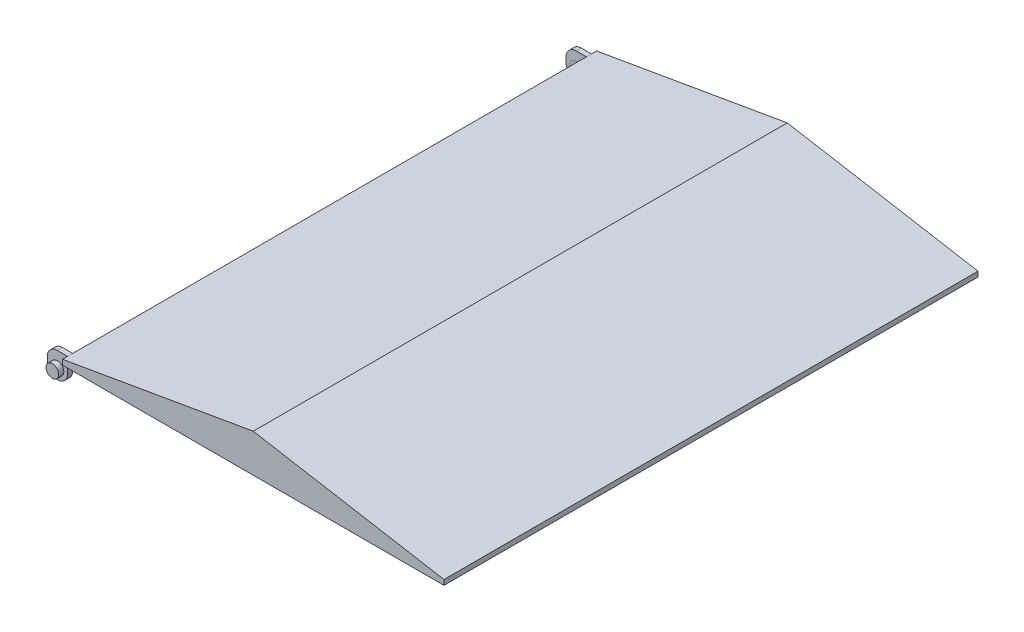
ISO-10303-21;
HEADER;
FILE_DESCRIPTION(('STEP AP214'),'2;1');
FILE_NAME('part.step','',(''),(''),'','','');
FILE_SCHEMA(('AUTOMOTIVE_DESIGN { 1 0 10303 214 1 1 1 1 }'));
ENDSEC;
DATA;
#1=APPLICATION_CONTEXT('core data for automotive mechanical design processes');
#2=APPLICATION_PROTOCOL_DEFINITION('international standard','automotive_design',2000,#1);
#3=PRODUCT_CONTEXT('',#1,'mechanical');
#4=PRODUCT('Part','Part','',(#3));
#5=PRODUCT_RELATED_PRODUCT_CATEGORY('part','',(#4));
#6=PRODUCT_DEFINITION_FORMATION('','',#4);
#7=PRODUCT_DEFINITION_CONTEXT('part definition',#1,'design');
#8=PRODUCT_DEFINITION('design','',#6,#7);
#9=PRODUCT_DEFINITION_SHAPE('','',#8);
#10=(LENGTH_UNIT() NAMED_UNIT(*) SI_UNIT(.MILLI.,.METRE.));
#11=(NAMED_UNIT(*) PLANE_ANGLE_UNIT() SI_UNIT($,.RADIAN.));
#12=(NAMED_UNIT(*) SI_UNIT($,.STERADIAN.) SOLID_ANGLE_UNIT());
#13=UNCERTAINTY_MEASURE_WITH_UNIT(LENGTH_MEASURE(1.E-05),#10,'distance_accuracy_value','');
#14=(GEOMETRIC_REPRESENTATION_CONTEXT(3) GLOBAL_UNCERTAINTY_ASSIGNED_CONTEXT((#13)) GLOBAL_UNIT_ASSIGNED_CONTEXT((#10,
#11,#12)) REPRESENTATION_CONTEXT('',''));
#15=CARTESIAN_POINT('',(0.,0.,0.));
#16=DIRECTION('',(0.,0.,1.));
#17=DIRECTION('',(1.,0.,0.));
#18=AXIS2_PLACEMENT_3D('',#15,#16,#17);
#19=CARTESIAN_POINT('',(-790.,-40.0000000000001,2100.));
#20=DIRECTION('',(0.,0.,-1.));
#21=DIRECTION('',(-1.,0.,0.));
#22=AXIS2_PLACEMENT_3D('',#19,#20,#21);
#23=CYLINDRICAL_SURFACE('',#22,25.);
#24=CARTESIAN_POINT('',(-790.,-40.0000000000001,2100.));
#25=DIRECTION('',(0.,0.,1.));
#26=DIRECTION('',(1.,0.,0.));
#27=AXIS2_PLACEMENT_3D('',#24,#25,#26);
#28=CIRCLE('',#27,25.);
#29=CARTESIAN_POINT('',(-765.,-40.0000000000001,2100.));
#30=VERTEX_POINT('',#29);
#31=EDGE_CURVE('E11',#30,#30,#28,.T.);
#32=ORIENTED_EDGE('',*,*,#31,.F.);
#33=EDGE_LOOP('',(#32));
#34=FACE_BOUND('',#33,.T.);
#35=CARTESIAN_POINT('',(-790.,-40.0000000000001,2060.));
#36=DIRECTION('',(0.,0.,1.));
#37=DIRECTION('',(1.,0.,0.));
#38=AXIS2_PLACEMENT_3D('',#35,#36,#37);
#39=CIRCLE('',#38,25.);
#40=CARTESIAN_POINT('',(-765.,-40.0000000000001,2060.));
#41=VERTEX_POINT('',#40);
#42=EDGE_CURVE('E53',#41,#41,#39,.T.);
#43=ORIENTED_EDGE('',*,*,#42,.T.);
#44=EDGE_LOOP('',(#43));
#45=FACE_BOUND('',#44,.T.);
#46=ADVANCED_FACE('F50',(#34,#45),#23,.T.);
#47=CARTESIAN_POINT('',(0.,0.,2100.));
#48=DIRECTION('',(0.,0.,1.));
#49=DIRECTION('',(1.,0.,0.));
#50=AXIS2_PLACEMENT_3D('',#47,#48,#49);
#51=PLANE('',#50);
#52=ORIENTED_EDGE('',*,*,#31,.T.);
#53=EDGE_LOOP('',(#52));
#54=FACE_BOUND('',#53,.T.);
#55=ADVANCED_FACE('F65',(#54),#51,.T.);
#56=CARTESIAN_POINT('',(0.,0.,2060.));
#57=DIRECTION('',(0.,0.,1.));
#58=DIRECTION('',(1.,0.,0.));
#59=AXIS2_PLACEMENT_3D('',#56,#57,#58);
#60=PLANE('',#59);
#61=ORIENTED_EDGE('',*,*,#42,.F.);
#62=EDGE_LOOP('',(#61));
#63=FACE_BOUND('',#62,.T.);
#64=ADVANCED_FACE('F63',(#63),#60,.F.);
#65=CLOSED_SHELL('',(#46,#55,#64));
#66=MANIFOLD_SOLID_BREP('B2',#65);
#67=CARTESIAN_POINT('',(-790.,-40.0000000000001,40.));
#68=DIRECTION('',(0.,0.,-1.));
#69=DIRECTION('',(-1.,0.,0.));
#70=AXIS2_PLACEMENT_3D('',#67,#68,#69);
#71=CYLINDRICAL_SURFACE('',#70,25.);
#72=CARTESIAN_POINT('',(-790.,-40.0000000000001,40.));
#73=DIRECTION('',(0.,0.,1.));
#74=DIRECTION('',(1.,0.,0.));
#75=AXIS2_PLACEMENT_3D('',#72,#73,#74);
#76=CIRCLE('',#75,25.);
#77=CARTESIAN_POINT('',(-765.,-40.0000000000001,40.));
#78=VERTEX_POINT('',#77);
#79=EDGE_CURVE('E49',#78,#78,#76,.T.);
#80=ORIENTED_EDGE('',*,*,#79,.F.);
#81=EDGE_LOOP('',(#80));
#82=FACE_BOUND('',#81,.T.);
#83=CARTESIAN_POINT('',(-790.,-40.0000000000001,0.));
#84=DIRECTION('',(0.,0.,1.));
#85=DIRECTION('',(1.,0.,0.));
#86=AXIS2_PLACEMENT_3D('',#83,#84,#85);
#87=CIRCLE('',#86,25.);
#88=CARTESIAN_POINT('',(-765.,-40.0000000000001,0.));
#89=VERTEX_POINT('',#88);
#90=EDGE_CURVE('E109',#89,#89,#87,.T.);
#91=ORIENTED_EDGE('',*,*,#90,.T.);
#92=EDGE_LOOP('',(#91));
#93=FACE_BOUND('',#92,.T.);
#94=ADVANCED_FACE('F106',(#82,#93),#71,.T.);
#95=CARTESIAN_POINT('',(0.,0.,40.));
#96=DIRECTION('',(0.,0.,1.));
#97=DIRECTION('',(1.,0.,0.));
#98=AXIS2_PLACEMENT_3D('',#95,#96,#97);
#99=PLANE('',#98);
#100=ORIENTED_EDGE('',*,*,#79,.T.);
#101=EDGE_LOOP('',(#100));
#102=FACE_BOUND('',#101,.T.);
#103=ADVANCED_FACE('F121',(#102),#99,.T.);
#104=CARTESIAN_POINT('',(0.,0.,0.));
#105=DIRECTION('',(0.,0.,1.));
#106=DIRECTION('',(1.,0.,0.));
#107=AXIS2_PLACEMENT_3D('',#104,#105,#106);
#108=PLANE('',#107);
#109=ORIENTED_EDGE('',*,*,#90,.F.);
#110=EDGE_LOOP('',(#109));
#111=FACE_BOUND('',#110,.T.);
#112=ADVANCED_FACE('F119',(#111),#108,.F.);
#113=CLOSED_SHELL('',(#94,#103,#112));
#114=MANIFOLD_SOLID_BREP('B6',#113);
#115=CARTESIAN_POINT('',(-750.,0.,2100.));
#116=DIRECTION('',(1.,0.,0.));
#117=DIRECTION('',(0.,0.,-1.));
#118=AXIS2_PLACEMENT_3D('',#115,#116,#117);
#119=PLANE('',#118);
#120=DIRECTION('',(0.,-1.,0.));
#121=VECTOR('',#120,1.);
#122=CARTESIAN_POINT('',(-750.,0.,2060.));
#123=LINE('',#122,#121);
#124=CARTESIAN_POINT('',(-750.,19.9999999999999,2060.));
#125=VERTEX_POINT('',#124);
#126=CARTESIAN_POINT('',(-750.,0.,2060.));
#127=VERTEX_POINT('',#126);
#128=EDGE_CURVE('E453',#125,#127,#123,.T.);
#129=ORIENTED_EDGE('',*,*,#128,.F.);
#130=DIRECTION('',(0.,0.,-1.));
#131=VECTOR('',#130,1.);
#132=CARTESIAN_POINT('',(-750.,19.9999999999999,2100.));
#133=LINE('',#132,#131);
#134=CARTESIAN_POINT('',(-750.,19.9999999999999,40.));
#135=VERTEX_POINT('',#134);
#136=EDGE_CURVE('E346',#125,#135,#133,.T.);
#137=ORIENTED_EDGE('',*,*,#136,.T.);
#138=DIRECTION('',(0.,-1.,0.));
#139=VECTOR('',#138,1.);
#140=CARTESIAN_POINT('',(-750.,0.,40.));
#141=LINE('',#140,#139);
#142=CARTESIAN_POINT('',(-750.,0.,40.));
#143=VERTEX_POINT('',#142);
#144=EDGE_CURVE('E462',#135,#143,#141,.T.);
#145=ORIENTED_EDGE('',*,*,#144,.T.);
#146=DIRECTION('',(0.,0.,-1.));
#147=VECTOR('',#146,1.);
#148=CARTESIAN_POINT('',(-750.,0.,2100.));
#149=LINE('',#148,#147);
#150=EDGE_CURVE('E367',#127,#143,#149,.T.);
#151=ORIENTED_EDGE('',*,*,#150,.F.);
#152=EDGE_LOOP('',(#129,#137,#145,#151));
#153=FACE_BOUND('',#152,.T.);
#154=ADVANCED_FACE('F154',(#153),#119,.F.);
#155=DIRECTION('',(0.,-1.,0.));
#156=VECTOR('',#155,1.);
#157=CARTESIAN_POINT('',(-750.,0.,20.));
#158=LINE('',#157,#156);
#159=CARTESIAN_POINT('',(-750.,19.9999999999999,20.));
#160=VERTEX_POINT('',#159);
#161=CARTESIAN_POINT('',(-750.,0.,20.));
#162=VERTEX_POINT('',#161);
#163=EDGE_CURVE('E474',#160,#162,#158,.T.);
#164=ORIENTED_EDGE('',*,*,#163,.F.);
#165=CARTESIAN_POINT('',(-750.,19.9999999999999,0.));
#166=VERTEX_POINT('',#165);
#167=EDGE_CURVE('E354',#160,#166,#133,.T.);
#168=ORIENTED_EDGE('',*,*,#167,.T.);
#169=DIRECTION('',(0.,-1.,0.));
#170=VECTOR('',#169,1.);
#171=CARTESIAN_POINT('',(-750.,0.,0.));
#172=LINE('',#171,#170);
#173=CARTESIAN_POINT('',(-750.,0.,0.));
#174=VERTEX_POINT('',#173);
#175=EDGE_CURVE('E525',#166,#174,#172,.T.);
#176=ORIENTED_EDGE('',*,*,#175,.T.);
#177=EDGE_CURVE('E372',#162,#174,#149,.T.);
#178=ORIENTED_EDGE('',*,*,#177,.F.);
#179=EDGE_LOOP('',(#164,#168,#176,#178));
#180=FACE_BOUND('',#179,.T.);
#181=ADVANCED_FACE('F542',(#180),#119,.F.);
#182=CARTESIAN_POINT('',(-25.2416292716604,145.624784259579,2100.));
#183=DIRECTION('',(-0.170786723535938,0.985308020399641,0.));
#184=DIRECTION('',(-0.985308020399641,-0.170786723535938,0.));
#185=AXIS2_PLACEMENT_3D('',#182,#183,#184);
#186=PLANE('',#185);
#187=DIRECTION('',(0.985308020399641,0.170786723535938,0.));
#188=VECTOR('',#187,1.);
#189=CARTESIAN_POINT('',(-25.2416292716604,145.624784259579,0.));
#190=LINE('',#189,#188);
#191=CARTESIAN_POINT('',(0.,150.,0.));
#192=VERTEX_POINT('',#191);
#193=EDGE_CURVE('E514',#166,#192,#190,.T.);
#194=ORIENTED_EDGE('',*,*,#193,.F.);
#195=ORIENTED_EDGE('',*,*,#167,.F.);
#196=DIRECTION('',(0.,0.,-1.));
#197=VECTOR('',#196,1.);
#198=CARTESIAN_POINT('',(-750.,19.9999999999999,40.));
#199=LINE('',#198,#197);
#200=EDGE_CURVE('E470',#135,#160,#199,.T.);
#201=ORIENTED_EDGE('',*,*,#200,.F.);
#202=ORIENTED_EDGE('',*,*,#136,.F.);
#203=DIRECTION('',(0.,0.,-1.));
#204=VECTOR('',#203,1.);
#205=CARTESIAN_POINT('',(-750.,19.9999999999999,2080.));
#206=LINE('',#205,#204);
#207=CARTESIAN_POINT('',(-750.,19.9999999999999,2080.));
#208=VERTEX_POINT('',#207);
#209=EDGE_CURVE('E321',#208,#125,#206,.T.);
#210=ORIENTED_EDGE('',*,*,#209,.F.);
#211=CARTESIAN_POINT('',(-750.,19.9999999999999,2100.));
#212=VERTEX_POINT('',#211);
#213=EDGE_CURVE('E342',#212,#208,#133,.T.);
#214=ORIENTED_EDGE('',*,*,#213,.F.);
#215=DIRECTION('',(0.985308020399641,0.170786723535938,0.));
#216=VECTOR('',#215,1.);
#217=CARTESIAN_POINT('',(-25.2416292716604,145.624784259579,2100.));
#218=LINE('',#217,#216);
#219=CARTESIAN_POINT('',(0.,150.,2100.));
#220=VERTEX_POINT('',#219);
#221=EDGE_CURVE('E522',#212,#220,#218,.T.);
#222=ORIENTED_EDGE('',*,*,#221,.T.);
#223=DIRECTION('',(0.,0.,-1.));
#224=VECTOR('',#223,1.);
#225=CARTESIAN_POINT('',(0.,150.,2100.));
#226=LINE('',#225,#224);
#227=EDGE_CURVE('E383',#220,#192,#226,.T.);
#228=ORIENTED_EDGE('',*,*,#227,.T.);
#229=EDGE_LOOP('',(#194,#195,#201,#202,#210,#214,#222,#228));
#230=FACE_BOUND('',#229,.T.);
#231=ADVANCED_FACE('F340',(#230),#186,.T.);
#232=ORIENTED_EDGE('',*,*,#213,.T.);
#233=DIRECTION('',(0.,-1.,0.));
#234=VECTOR('',#233,1.);
#235=CARTESIAN_POINT('',(-750.,0.,2080.));
#236=LINE('',#235,#234);
#237=CARTESIAN_POINT('',(-750.,0.,2080.));
#238=VERTEX_POINT('',#237);
#239=EDGE_CURVE('E325',#208,#238,#236,.T.);
#240=ORIENTED_EDGE('',*,*,#239,.T.);
#241=CARTESIAN_POINT('',(-750.,0.,2100.));
#242=VERTEX_POINT('',#241);
#243=EDGE_CURVE('E360',#242,#238,#149,.T.);
#244=ORIENTED_EDGE('',*,*,#243,.F.);
#245=DIRECTION('',(0.,-1.,0.));
#246=VECTOR('',#245,1.);
#247=CARTESIAN_POINT('',(-750.,0.,2100.));
#248=LINE('',#247,#246);
#249=EDGE_CURVE('E350',#212,#242,#248,.T.);
#250=ORIENTED_EDGE('',*,*,#249,.F.);
#251=EDGE_LOOP('',(#232,#240,#244,#250));
#252=FACE_BOUND('',#251,.T.);
#253=ADVANCED_FACE('F349',(#252),#119,.F.);
#254=CARTESIAN_POINT('',(0.,0.,2100.));
#255=DIRECTION('',(0.,-1.,0.));
#256=DIRECTION('',(1.,0.,0.));
#257=AXIS2_PLACEMENT_3D('',#254,#255,#256);
#258=PLANE('',#257);
#259=DIRECTION('',(-1.,0.,0.));
#260=VECTOR('',#259,1.);
#261=CARTESIAN_POINT('',(0.,0.,0.));
#262=LINE('',#261,#260);
#263=CARTESIAN_POINT('',(750.,0.,0.));
#264=VERTEX_POINT('',#263);
#265=EDGE_CURVE('E540',#264,#174,#262,.T.);
#266=ORIENTED_EDGE('',*,*,#265,.F.);
#267=DIRECTION('',(0.,0.,-1.));
#268=VECTOR('',#267,1.);
#269=CARTESIAN_POINT('',(750.,0.,2100.));
#270=LINE('',#269,#268);
#271=CARTESIAN_POINT('',(750.,0.,2100.));
#272=VERTEX_POINT('',#271);
#273=EDGE_CURVE('E376',#272,#264,#270,.T.);
#274=ORIENTED_EDGE('',*,*,#273,.F.);
#275=DIRECTION('',(-1.,0.,0.));
#276=VECTOR('',#275,1.);
#277=CARTESIAN_POINT('',(0.,0.,2100.));
#278=LINE('',#277,#276);
#279=EDGE_CURVE('E529',#272,#242,#278,.T.);
#280=ORIENTED_EDGE('',*,*,#279,.T.);
#281=ORIENTED_EDGE('',*,*,#243,.T.);
#282=EDGE_CURVE('E366',#238,#127,#149,.T.);
#283=ORIENTED_EDGE('',*,*,#282,.T.);
#284=ORIENTED_EDGE('',*,*,#150,.T.);
#285=EDGE_CURVE('E368',#143,#162,#149,.T.);
#286=ORIENTED_EDGE('',*,*,#285,.T.);
#287=ORIENTED_EDGE('',*,*,#177,.T.);
#288=EDGE_LOOP('',(#266,#274,#280,#281,#283,#284,#286,#287));
#289=FACE_BOUND('',#288,.T.);
#290=ADVANCED_FACE('F546',(#289),#258,.T.);
#291=CARTESIAN_POINT('',(750.,0.,2100.));
#292=DIRECTION('',(1.,0.,0.));
#293=DIRECTION('',(0.,0.,-1.));
#294=AXIS2_PLACEMENT_3D('',#291,#292,#293);
#295=PLANE('',#294);
#296=DIRECTION('',(0.,-1.,0.));
#297=VECTOR('',#296,1.);
#298=CARTESIAN_POINT('',(750.,0.,0.));
#299=LINE('',#298,#297);
#300=CARTESIAN_POINT('',(750.,20.0000000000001,0.));
#301=VERTEX_POINT('',#300);
#302=EDGE_CURVE('E537',#301,#264,#299,.T.);
#303=ORIENTED_EDGE('',*,*,#302,.F.);
#304=DIRECTION('',(0.,0.,-1.));
#305=VECTOR('',#304,1.);
#306=CARTESIAN_POINT('',(750.,20.0000000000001,2100.));
#307=LINE('',#306,#305);
#308=CARTESIAN_POINT('',(750.,20.0000000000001,2100.));
#309=VERTEX_POINT('',#308);
#310=EDGE_CURVE('E379',#309,#301,#307,.T.);
#311=ORIENTED_EDGE('',*,*,#310,.F.);
#312=DIRECTION('',(0.,-1.,0.));
#313=VECTOR('',#312,1.);
#314=CARTESIAN_POINT('',(750.,0.,2100.));
#315=LINE('',#314,#313);
#316=EDGE_CURVE('E527',#309,#272,#315,.T.);
#317=ORIENTED_EDGE('',*,*,#316,.T.);
#318=ORIENTED_EDGE('',*,*,#273,.T.);
#319=EDGE_LOOP('',(#303,#311,#317,#318));
#320=FACE_BOUND('',#319,.T.);
#321=ADVANCED_FACE('F551',(#320),#295,.T.);
#322=CARTESIAN_POINT('',(25.2416292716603,145.624784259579,2100.));
#323=DIRECTION('',(-0.170786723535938,-0.985308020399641,0.));
#324=DIRECTION('',(0.985308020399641,-0.170786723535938,0.));
#325=AXIS2_PLACEMENT_3D('',#322,#323,#324);
#326=PLANE('',#325);
#327=DIRECTION('',(-0.985308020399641,0.170786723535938,0.));
#328=VECTOR('',#327,1.);
#329=CARTESIAN_POINT('',(25.2416292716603,145.624784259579,0.));
#330=LINE('',#329,#328);
#331=EDGE_CURVE('E534',#301,#192,#330,.T.);
#332=ORIENTED_EDGE('',*,*,#331,.T.);
#333=ORIENTED_EDGE('',*,*,#227,.F.);
#334=DIRECTION('',(-0.985308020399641,0.170786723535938,0.));
#335=VECTOR('',#334,1.);
#336=CARTESIAN_POINT('',(25.2416292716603,145.624784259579,2100.));
#337=LINE('',#336,#335);
#338=EDGE_CURVE('E524',#309,#220,#337,.T.);
#339=ORIENTED_EDGE('',*,*,#338,.F.);
#340=ORIENTED_EDGE('',*,*,#310,.T.);
#341=EDGE_LOOP('',(#332,#333,#339,#340));
#342=FACE_BOUND('',#341,.T.);
#343=ADVANCED_FACE('F555',(#342),#326,.F.);
#344=CARTESIAN_POINT('',(0.,0.,2100.));
#345=DIRECTION('',(0.,0.,-1.));
#346=DIRECTION('',(-1.,0.,0.));
#347=AXIS2_PLACEMENT_3D('',#344,#345,#346);
#348=PLANE('',#347);
#349=ORIENTED_EDGE('',*,*,#221,.F.);
#350=ORIENTED_EDGE('',*,*,#249,.T.);
#351=ORIENTED_EDGE('',*,*,#279,.F.);
#352=ORIENTED_EDGE('',*,*,#316,.F.);
#353=ORIENTED_EDGE('',*,*,#338,.T.);
#354=EDGE_LOOP('',(#349,#350,#351,#352,#353));
#355=FACE_BOUND('',#354,.T.);
#356=ADVANCED_FACE('F550',(#355),#348,.F.);
#357=CARTESIAN_POINT('',(0.,0.,0.));
#358=DIRECTION('',(0.,0.,-1.));
#359=DIRECTION('',(-1.,0.,0.));
#360=AXIS2_PLACEMENT_3D('',#357,#358,#359);
#361=PLANE('',#360);
#362=ORIENTED_EDGE('',*,*,#193,.T.);
#363=ORIENTED_EDGE('',*,*,#331,.F.);
#364=ORIENTED_EDGE('',*,*,#302,.T.);
#365=ORIENTED_EDGE('',*,*,#265,.T.);
#366=ORIENTED_EDGE('',*,*,#175,.F.);
#367=EDGE_LOOP('',(#362,#363,#364,#365,#366));
#368=FACE_BOUND('',#367,.T.);
#369=ADVANCED_FACE('F544',(#368),#361,.T.);
#370=CARTESIAN_POINT('',(-750.,0.,40.));
#371=DIRECTION('',(1.,0.,0.));
#372=DIRECTION('',(0.,0.,-1.));
#373=AXIS2_PLACEMENT_3D('',#370,#371,#372);
#374=PLANE('',#373);
#375=CARTESIAN_POINT('',(-750.,-40.0000000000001,40.));
#376=VERTEX_POINT('',#375);
#377=EDGE_CURVE('E460',#143,#376,#141,.T.);
#378=ORIENTED_EDGE('',*,*,#377,.T.);
#379=DIRECTION('',(0.,0.,-1.));
#380=VECTOR('',#379,1.);
#381=CARTESIAN_POINT('',(-750.,-40.0000000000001,40.));
#382=LINE('',#381,#380);
#383=CARTESIAN_POINT('',(-750.,-40.0000000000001,20.));
#384=VERTEX_POINT('',#383);
#385=EDGE_CURVE('E352',#376,#384,#382,.T.);
#386=ORIENTED_EDGE('',*,*,#385,.T.);
#387=EDGE_CURVE('E473',#162,#384,#158,.T.);
#388=ORIENTED_EDGE('',*,*,#387,.F.);
#389=ORIENTED_EDGE('',*,*,#285,.F.);
#390=EDGE_LOOP('',(#378,#386,#388,#389));
#391=FACE_BOUND('',#390,.T.);
#392=ADVANCED_FACE('F585',(#391),#374,.T.);
#393=CARTESIAN_POINT('',(0.,19.9999999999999,40.));
#394=DIRECTION('',(0.,1.,0.));
#395=DIRECTION('',(0.,0.,1.));
#396=AXIS2_PLACEMENT_3D('',#393,#394,#395);
#397=PLANE('',#396);
#398=DIRECTION('',(1.,0.,0.));
#399=VECTOR('',#398,1.);
#400=CARTESIAN_POINT('',(0.,19.9999999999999,20.));
#401=LINE('',#400,#399);
#402=CARTESIAN_POINT('',(-790.,19.9999999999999,20.));
#403=VERTEX_POINT('',#402);
#404=EDGE_CURVE('E477',#403,#160,#401,.T.);
#405=ORIENTED_EDGE('',*,*,#404,.F.);
#406=DIRECTION('',(0.,0.,-1.));
#407=VECTOR('',#406,1.);
#408=CARTESIAN_POINT('',(-790.,19.9999999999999,40.));
#409=LINE('',#408,#407);
#410=CARTESIAN_POINT('',(-790.,19.9999999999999,40.));
#411=VERTEX_POINT('',#410);
#412=EDGE_CURVE('E403',#403,#411,#409,.F.);
#413=ORIENTED_EDGE('',*,*,#412,.T.);
#414=DIRECTION('',(1.,0.,0.));
#415=VECTOR('',#414,1.);
#416=CARTESIAN_POINT('',(0.,19.9999999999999,40.));
#417=LINE('',#416,#415);
#418=EDGE_CURVE('E465',#411,#135,#417,.T.);
#419=ORIENTED_EDGE('',*,*,#418,.T.);
#420=ORIENTED_EDGE('',*,*,#200,.T.);
#421=EDGE_LOOP('',(#405,#413,#419,#420));
#422=FACE_BOUND('',#421,.T.);
#423=ADVANCED_FACE('F558',(#422),#397,.T.);
#424=CARTESIAN_POINT('',(-830.,0.,40.));
#425=DIRECTION('',(-1.,0.,0.));
#426=DIRECTION('',(0.,0.,1.));
#427=AXIS2_PLACEMENT_3D('',#424,#425,#426);
#428=PLANE('',#427);
#429=DIRECTION('',(0.,1.,0.));
#430=VECTOR('',#429,1.);
#431=CARTESIAN_POINT('',(-830.,0.,20.));
#432=LINE('',#431,#430);
#433=CARTESIAN_POINT('',(-830.,-40.0000000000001,20.));
#434=VERTEX_POINT('',#433);
#435=CARTESIAN_POINT('',(-830.,-20.0000000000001,20.));
#436=VERTEX_POINT('',#435);
#437=EDGE_CURVE('E461',#434,#436,#432,.T.);
#438=ORIENTED_EDGE('',*,*,#437,.F.);
#439=DIRECTION('',(0.,0.,-1.));
#440=VECTOR('',#439,1.);
#441=CARTESIAN_POINT('',(-830.,-40.0000000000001,40.));
#442=LINE('',#441,#440);
#443=CARTESIAN_POINT('',(-830.,-40.0000000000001,40.));
#444=VERTEX_POINT('',#443);
#445=EDGE_CURVE('E401',#434,#444,#442,.F.);
#446=ORIENTED_EDGE('',*,*,#445,.T.);
#447=DIRECTION('',(0.,1.,0.));
#448=VECTOR('',#447,1.);
#449=CARTESIAN_POINT('',(-830.,0.,40.));
#450=LINE('',#449,#448);
#451=CARTESIAN_POINT('',(-830.,-20.0000000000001,40.));
#452=VERTEX_POINT('',#451);
#453=EDGE_CURVE('E467',#444,#452,#450,.T.);
#454=ORIENTED_EDGE('',*,*,#453,.T.);
#455=DIRECTION('',(0.,0.,-1.));
#456=VECTOR('',#455,1.);
#457=CARTESIAN_POINT('',(-830.,-20.0000000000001,40.));
#458=LINE('',#457,#456);
#459=EDGE_CURVE('E398',#452,#436,#458,.T.);
#460=ORIENTED_EDGE('',*,*,#459,.T.);
#461=EDGE_LOOP('',(#438,#446,#454,#460));
#462=FACE_BOUND('',#461,.T.);
#463=ADVANCED_FACE('F570',(#462),#428,.T.);
#464=CARTESIAN_POINT('',(-790.,-40.0000000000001,40.));
#465=DIRECTION('',(0.,0.,-1.));
#466=DIRECTION('',(-1.,0.,0.));
#467=AXIS2_PLACEMENT_3D('',#464,#465,#466);
#468=CYLINDRICAL_SURFACE('',#467,25.);
#469=CARTESIAN_POINT('',(-790.,-40.0000000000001,40.));
#470=DIRECTION('',(0.,0.,1.));
#471=DIRECTION('',(1.,0.,0.));
#472=AXIS2_PLACEMENT_3D('',#469,#470,#471);
#473=CIRCLE('',#472,25.);
#474=CARTESIAN_POINT('',(-765.,-40.0000000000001,40.));
#475=VERTEX_POINT('',#474);
#476=EDGE_CURVE('E457',#475,#475,#473,.T.);
#477=ORIENTED_EDGE('',*,*,#476,.T.);
#478=EDGE_LOOP('',(#477));
#479=FACE_BOUND('',#478,.T.);
#480=CARTESIAN_POINT('',(-790.,-40.0000000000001,20.));
#481=DIRECTION('',(0.,0.,1.));
#482=DIRECTION('',(1.,0.,0.));
#483=AXIS2_PLACEMENT_3D('',#480,#481,#482);
#484=CIRCLE('',#483,25.);
#485=CARTESIAN_POINT('',(-765.,-40.0000000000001,20.));
#486=VERTEX_POINT('',#485);
#487=EDGE_CURVE('E347',#486,#486,#484,.T.);
#488=ORIENTED_EDGE('',*,*,#487,.F.);
#489=EDGE_LOOP('',(#488));
#490=FACE_BOUND('',#489,.T.);
#491=ADVANCED_FACE('F737',(#479,#490),#468,.F.);
#492=CARTESIAN_POINT('',(0.,0.,40.));
#493=DIRECTION('',(0.,0.,1.));
#494=DIRECTION('',(1.,0.,0.));
#495=AXIS2_PLACEMENT_3D('',#492,#493,#494);
#496=PLANE('',#495);
#497=ORIENTED_EDGE('',*,*,#476,.F.);
#498=EDGE_LOOP('',(#497));
#499=FACE_BOUND('',#498,.T.);
#500=CARTESIAN_POINT('',(-790.,-40.0000000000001,40.));
#501=DIRECTION('',(0.,0.,1.));
#502=DIRECTION('',(1.,0.,0.));
#503=AXIS2_PLACEMENT_3D('',#500,#501,#502);
#504=CIRCLE('',#503,40.);
#505=CARTESIAN_POINT('',(-790.,-80.0000000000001,40.));
#506=VERTEX_POINT('',#505);
#507=EDGE_CURVE('E394',#444,#506,#504,.T.);
#508=ORIENTED_EDGE('',*,*,#507,.T.);
#509=CARTESIAN_POINT('',(-790.,-40.0000000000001,40.));
#510=DIRECTION('',(0.,0.,1.));
#511=DIRECTION('',(1.,0.,0.));
#512=AXIS2_PLACEMENT_3D('',#509,#510,#511);
#513=CIRCLE('',#512,40.);
#514=EDGE_CURVE('E396',#506,#376,#513,.T.);
#515=ORIENTED_EDGE('',*,*,#514,.T.);
#516=ORIENTED_EDGE('',*,*,#377,.F.);
#517=ORIENTED_EDGE('',*,*,#144,.F.);
#518=ORIENTED_EDGE('',*,*,#418,.F.);
#519=CARTESIAN_POINT('',(-790.,-20.0000000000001,40.));
#520=DIRECTION('',(0.,0.,1.));
#521=DIRECTION('',(1.,0.,0.));
#522=AXIS2_PLACEMENT_3D('',#519,#520,#521);
#523=CIRCLE('',#522,40.);
#524=EDGE_CURVE('E392',#411,#452,#523,.T.);
#525=ORIENTED_EDGE('',*,*,#524,.T.);
#526=ORIENTED_EDGE('',*,*,#453,.F.);
#527=EDGE_LOOP('',(#508,#515,#516,#517,#518,#525,#526));
#528=FACE_BOUND('',#527,.T.);
#529=ADVANCED_FACE('F575',(#499,#528),#496,.T.);
#530=CARTESIAN_POINT('',(0.,0.,20.));
#531=DIRECTION('',(0.,0.,1.));
#532=DIRECTION('',(1.,0.,0.));
#533=AXIS2_PLACEMENT_3D('',#530,#531,#532);
#534=PLANE('',#533);
#535=ORIENTED_EDGE('',*,*,#487,.T.);
#536=EDGE_LOOP('',(#535));
#537=FACE_BOUND('',#536,.T.);
#538=ORIENTED_EDGE('',*,*,#387,.T.);
#539=CARTESIAN_POINT('',(-790.,-40.0000000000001,20.));
#540=DIRECTION('',(0.,0.,1.));
#541=DIRECTION('',(1.,0.,0.));
#542=AXIS2_PLACEMENT_3D('',#539,#540,#541);
#543=CIRCLE('',#542,40.);
#544=CARTESIAN_POINT('',(-790.,-80.0000000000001,20.));
#545=VERTEX_POINT('',#544);
#546=EDGE_CURVE('E390',#384,#545,#543,.F.);
#547=ORIENTED_EDGE('',*,*,#546,.T.);
#548=CARTESIAN_POINT('',(-790.,-40.0000000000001,20.));
#549=DIRECTION('',(0.,0.,1.));
#550=DIRECTION('',(1.,0.,0.));
#551=AXIS2_PLACEMENT_3D('',#548,#549,#550);
#552=CIRCLE('',#551,40.);
#553=EDGE_CURVE('E388',#545,#434,#552,.F.);
#554=ORIENTED_EDGE('',*,*,#553,.T.);
#555=ORIENTED_EDGE('',*,*,#437,.T.);
#556=CARTESIAN_POINT('',(-790.,-20.0000000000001,20.));
#557=DIRECTION('',(0.,0.,1.));
#558=DIRECTION('',(1.,0.,0.));
#559=AXIS2_PLACEMENT_3D('',#556,#557,#558);
#560=CIRCLE('',#559,40.);
#561=EDGE_CURVE('E356',#436,#403,#560,.F.);
#562=ORIENTED_EDGE('',*,*,#561,.T.);
#563=ORIENTED_EDGE('',*,*,#404,.T.);
#564=ORIENTED_EDGE('',*,*,#163,.T.);
#565=EDGE_LOOP('',(#538,#547,#554,#555,#562,#563,#564));
#566=FACE_BOUND('',#565,.T.);
#567=ADVANCED_FACE('F563',(#537,#566),#534,.F.);
#568=CARTESIAN_POINT('',(-750.,0.,2080.));
#569=DIRECTION('',(1.,0.,0.));
#570=DIRECTION('',(0.,0.,-1.));
#571=AXIS2_PLACEMENT_3D('',#568,#569,#570);
#572=PLANE('',#571);
#573=CARTESIAN_POINT('',(-750.,-40.0000000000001,2080.));
#574=VERTEX_POINT('',#573);
#575=EDGE_CURVE('E331',#238,#574,#236,.T.);
#576=ORIENTED_EDGE('',*,*,#575,.T.);
#577=DIRECTION('',(0.,0.,-1.));
#578=VECTOR('',#577,1.);
#579=CARTESIAN_POINT('',(-750.,-40.0000000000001,2080.));
#580=LINE('',#579,#578);
#581=CARTESIAN_POINT('',(-750.,-40.0000000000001,2060.));
#582=VERTEX_POINT('',#581);
#583=EDGE_CURVE('E405',#574,#582,#580,.T.);
#584=ORIENTED_EDGE('',*,*,#583,.T.);
#585=EDGE_CURVE('E428',#127,#582,#123,.T.);
#586=ORIENTED_EDGE('',*,*,#585,.F.);
#587=ORIENTED_EDGE('',*,*,#282,.F.);
#588=EDGE_LOOP('',(#576,#584,#586,#587));
#589=FACE_BOUND('',#588,.T.);
#590=ADVANCED_FACE('F703',(#589),#572,.T.);
#591=CARTESIAN_POINT('',(0.,19.9999999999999,2080.));
#592=DIRECTION('',(0.,1.,0.));
#593=DIRECTION('',(0.,0.,1.));
#594=AXIS2_PLACEMENT_3D('',#591,#592,#593);
#595=PLANE('',#594);
#596=DIRECTION('',(1.,0.,0.));
#597=VECTOR('',#596,1.);
#598=CARTESIAN_POINT('',(0.,19.9999999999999,2060.));
#599=LINE('',#598,#597);
#600=CARTESIAN_POINT('',(-790.,19.9999999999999,2060.));
#601=VERTEX_POINT('',#600);
#602=EDGE_CURVE('E449',#601,#125,#599,.T.);
#603=ORIENTED_EDGE('',*,*,#602,.F.);
#604=DIRECTION('',(0.,0.,-1.));
#605=VECTOR('',#604,1.);
#606=CARTESIAN_POINT('',(-790.,19.9999999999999,2080.));
#607=LINE('',#606,#605);
#608=CARTESIAN_POINT('',(-790.,19.9999999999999,2080.));
#609=VERTEX_POINT('',#608);
#610=EDGE_CURVE('E104',#601,#609,#607,.F.);
#611=ORIENTED_EDGE('',*,*,#610,.T.);
#612=DIRECTION('',(1.,0.,0.));
#613=VECTOR('',#612,1.);
#614=CARTESIAN_POINT('',(0.,19.9999999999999,2080.));
#615=LINE('',#614,#613);
#616=EDGE_CURVE('E316',#609,#208,#615,.T.);
#617=ORIENTED_EDGE('',*,*,#616,.T.);
#618=ORIENTED_EDGE('',*,*,#209,.T.);
#619=EDGE_LOOP('',(#603,#611,#617,#618));
#620=FACE_BOUND('',#619,.T.);
#621=ADVANCED_FACE('F319',(#620),#595,.T.);
#622=CARTESIAN_POINT('',(-830.,0.,2080.));
#623=DIRECTION('',(-1.,0.,0.));
#624=DIRECTION('',(0.,0.,1.));
#625=AXIS2_PLACEMENT_3D('',#622,#623,#624);
#626=PLANE('',#625);
#627=DIRECTION('',(0.,1.,0.));
#628=VECTOR('',#627,1.);
#629=CARTESIAN_POINT('',(-830.,0.,2060.));
#630=LINE('',#629,#628);
#631=CARTESIAN_POINT('',(-830.,-40.0000000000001,2060.));
#632=VERTEX_POINT('',#631);
#633=CARTESIAN_POINT('',(-830.,-20.0000000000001,2060.));
#634=VERTEX_POINT('',#633);
#635=EDGE_CURVE('E444',#632,#634,#630,.T.);
#636=ORIENTED_EDGE('',*,*,#635,.F.);
#637=DIRECTION('',(0.,0.,-1.));
#638=VECTOR('',#637,1.);
#639=CARTESIAN_POINT('',(-830.,-40.0000000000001,2080.));
#640=LINE('',#639,#638);
#641=CARTESIAN_POINT('',(-830.,-40.0000000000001,2080.));
#642=VERTEX_POINT('',#641);
#643=EDGE_CURVE('E163',#632,#642,#640,.F.);
#644=ORIENTED_EDGE('',*,*,#643,.T.);
#645=DIRECTION('',(0.,1.,0.));
#646=VECTOR('',#645,1.);
#647=CARTESIAN_POINT('',(-830.,0.,2080.));
#648=LINE('',#647,#646);
#649=CARTESIAN_POINT('',(-830.,-20.0000000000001,2080.));
#650=VERTEX_POINT('',#649);
#651=EDGE_CURVE('E324',#642,#650,#648,.T.);
#652=ORIENTED_EDGE('',*,*,#651,.T.);
#653=DIRECTION('',(0.,0.,-1.));
#654=VECTOR('',#653,1.);
#655=CARTESIAN_POINT('',(-830.,-20.0000000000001,2080.));
#656=LINE('',#655,#654);
#657=EDGE_CURVE('E418',#650,#634,#656,.T.);
#658=ORIENTED_EDGE('',*,*,#657,.T.);
#659=EDGE_LOOP('',(#636,#644,#652,#658));
#660=FACE_BOUND('',#659,.T.);
#661=ADVANCED_FACE('F446',(#660),#626,.T.);
#662=CARTESIAN_POINT('',(-790.,-40.0000000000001,2080.));
#663=DIRECTION('',(0.,0.,-1.));
#664=DIRECTION('',(-1.,0.,0.));
#665=AXIS2_PLACEMENT_3D('',#662,#663,#664);
#666=CYLINDRICAL_SURFACE('',#665,25.);
#667=CARTESIAN_POINT('',(-790.,-40.0000000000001,2080.));
#668=DIRECTION('',(0.,0.,1.));
#669=DIRECTION('',(1.,0.,0.));
#670=AXIS2_PLACEMENT_3D('',#667,#668,#669);
#671=CIRCLE('',#670,25.);
#672=CARTESIAN_POINT('',(-765.,-40.0000000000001,2080.));
#673=VERTEX_POINT('',#672);
#674=EDGE_CURVE('E448',#673,#673,#671,.T.);
#675=ORIENTED_EDGE('',*,*,#674,.T.);
#676=EDGE_LOOP('',(#675));
#677=FACE_BOUND('',#676,.T.);
#678=CARTESIAN_POINT('',(-790.,-40.0000000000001,2060.));
#679=DIRECTION('',(0.,0.,1.));
#680=DIRECTION('',(1.,0.,0.));
#681=AXIS2_PLACEMENT_3D('',#678,#679,#680);
#682=CIRCLE('',#681,25.);
#683=CARTESIAN_POINT('',(-765.,-40.0000000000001,2060.));
#684=VERTEX_POINT('',#683);
#685=EDGE_CURVE('E423',#684,#684,#682,.T.);
#686=ORIENTED_EDGE('',*,*,#685,.F.);
#687=EDGE_LOOP('',(#686));
#688=FACE_BOUND('',#687,.T.);
#689=ADVANCED_FACE('F676',(#677,#688),#666,.F.);
#690=CARTESIAN_POINT('',(0.,0.,2080.));
#691=DIRECTION('',(0.,0.,1.));
#692=DIRECTION('',(1.,0.,0.));
#693=AXIS2_PLACEMENT_3D('',#690,#691,#692);
#694=PLANE('',#693);
#695=ORIENTED_EDGE('',*,*,#674,.F.);
#696=EDGE_LOOP('',(#695));
#697=FACE_BOUND('',#696,.T.);
#698=CARTESIAN_POINT('',(-790.,-40.0000000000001,2080.));
#699=DIRECTION('',(0.,0.,1.));
#700=DIRECTION('',(1.,0.,0.));
#701=AXIS2_PLACEMENT_3D('',#698,#699,#700);
#702=CIRCLE('',#701,40.);
#703=CARTESIAN_POINT('',(-790.,-80.0000000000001,2080.));
#704=VERTEX_POINT('',#703);
#705=EDGE_CURVE('E171',#642,#704,#702,.T.);
#706=ORIENTED_EDGE('',*,*,#705,.T.);
#707=CARTESIAN_POINT('',(-790.,-40.0000000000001,2080.));
#708=DIRECTION('',(0.,0.,1.));
#709=DIRECTION('',(1.,0.,0.));
#710=AXIS2_PLACEMENT_3D('',#707,#708,#709);
#711=CIRCLE('',#710,40.);
#712=EDGE_CURVE('E416',#704,#574,#711,.T.);
#713=ORIENTED_EDGE('',*,*,#712,.T.);
#714=ORIENTED_EDGE('',*,*,#575,.F.);
#715=ORIENTED_EDGE('',*,*,#239,.F.);
#716=ORIENTED_EDGE('',*,*,#616,.F.);
#717=CARTESIAN_POINT('',(-790.,-20.0000000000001,2080.));
#718=DIRECTION('',(0.,0.,1.));
#719=DIRECTION('',(1.,0.,0.));
#720=AXIS2_PLACEMENT_3D('',#717,#718,#719);
#721=CIRCLE('',#720,40.);
#722=EDGE_CURVE('E177',#609,#650,#721,.T.);
#723=ORIENTED_EDGE('',*,*,#722,.T.);
#724=ORIENTED_EDGE('',*,*,#651,.F.);
#725=EDGE_LOOP('',(#706,#713,#714,#715,#716,#723,#724));
#726=FACE_BOUND('',#725,.T.);
#727=ADVANCED_FACE('F329',(#697,#726),#694,.T.);
#728=CARTESIAN_POINT('',(0.,0.,2060.));
#729=DIRECTION('',(0.,0.,1.));
#730=DIRECTION('',(1.,0.,0.));
#731=AXIS2_PLACEMENT_3D('',#728,#729,#730);
#732=PLANE('',#731);
#733=ORIENTED_EDGE('',*,*,#685,.T.);
#734=EDGE_LOOP('',(#733));
#735=FACE_BOUND('',#734,.T.);
#736=ORIENTED_EDGE('',*,*,#585,.T.);
#737=CARTESIAN_POINT('',(-790.,-40.0000000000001,2060.));
#738=DIRECTION('',(0.,0.,1.));
#739=DIRECTION('',(1.,0.,0.));
#740=AXIS2_PLACEMENT_3D('',#737,#738,#739);
#741=CIRCLE('',#740,40.);
#742=CARTESIAN_POINT('',(-790.,-80.0000000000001,2060.));
#743=VERTEX_POINT('',#742);
#744=EDGE_CURVE('E412',#582,#743,#741,.F.);
#745=ORIENTED_EDGE('',*,*,#744,.T.);
#746=CARTESIAN_POINT('',(-790.,-40.0000000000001,2060.));
#747=DIRECTION('',(0.,0.,1.));
#748=DIRECTION('',(1.,0.,0.));
#749=AXIS2_PLACEMENT_3D('',#746,#747,#748);
#750=CIRCLE('',#749,40.);
#751=EDGE_CURVE('E410',#743,#632,#750,.F.);
#752=ORIENTED_EDGE('',*,*,#751,.T.);
#753=ORIENTED_EDGE('',*,*,#635,.T.);
#754=CARTESIAN_POINT('',(-790.,-20.0000000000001,2060.));
#755=DIRECTION('',(0.,0.,1.));
#756=DIRECTION('',(1.,0.,0.));
#757=AXIS2_PLACEMENT_3D('',#754,#755,#756);
#758=CIRCLE('',#757,40.);
#759=EDGE_CURVE('E408',#634,#601,#758,.F.);
#760=ORIENTED_EDGE('',*,*,#759,.T.);
#761=ORIENTED_EDGE('',*,*,#602,.T.);
#762=ORIENTED_EDGE('',*,*,#128,.T.);
#763=EDGE_LOOP('',(#736,#745,#752,#753,#760,#761,#762));
#764=FACE_BOUND('',#763,.T.);
#765=ADVANCED_FACE('F443',(#735,#764),#732,.F.);
#766=CARTESIAN_POINT('',(-790.,-40.0000000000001,40.));
#767=DIRECTION('',(0.,0.,-1.));
#768=DIRECTION('',(-1.,0.,0.));
#769=AXIS2_PLACEMENT_3D('',#766,#767,#768);
#770=CYLINDRICAL_SURFACE('',#769,40.);
#771=DIRECTION('',(0.,0.,-1.));
#772=VECTOR('',#771,1.);
#773=CARTESIAN_POINT('',(-790.,-80.0000000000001,40.));
#774=LINE('',#773,#772);
#775=EDGE_CURVE('E421',#506,#545,#774,.T.);
#776=ORIENTED_EDGE('',*,*,#775,.F.);
#777=ORIENTED_EDGE('',*,*,#507,.F.);
#778=ORIENTED_EDGE('',*,*,#445,.F.);
#779=ORIENTED_EDGE('',*,*,#553,.F.);
#780=EDGE_LOOP('',(#776,#777,#778,#779));
#781=FACE_BOUND('',#780,.T.);
#782=ADVANCED_FACE('F577',(#781),#770,.T.);
#783=CARTESIAN_POINT('',(-790.,-40.0000000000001,40.));
#784=DIRECTION('',(0.,0.,-1.));
#785=DIRECTION('',(-1.,0.,0.));
#786=AXIS2_PLACEMENT_3D('',#783,#784,#785);
#787=CYLINDRICAL_SURFACE('',#786,40.);
#788=ORIENTED_EDGE('',*,*,#514,.F.);
#789=ORIENTED_EDGE('',*,*,#775,.T.);
#790=ORIENTED_EDGE('',*,*,#546,.F.);
#791=ORIENTED_EDGE('',*,*,#385,.F.);
#792=EDGE_LOOP('',(#788,#789,#790,#791));
#793=FACE_BOUND('',#792,.T.);
#794=ADVANCED_FACE('F580',(#793),#787,.T.);
#795=CARTESIAN_POINT('',(-790.,-20.0000000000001,40.));
#796=DIRECTION('',(0.,0.,-1.));
#797=DIRECTION('',(-1.,0.,0.));
#798=AXIS2_PLACEMENT_3D('',#795,#796,#797);
#799=CYLINDRICAL_SURFACE('',#798,40.);
#800=ORIENTED_EDGE('',*,*,#524,.F.);
#801=ORIENTED_EDGE('',*,*,#412,.F.);
#802=ORIENTED_EDGE('',*,*,#561,.F.);
#803=ORIENTED_EDGE('',*,*,#459,.F.);
#804=EDGE_LOOP('',(#800,#801,#802,#803));
#805=FACE_BOUND('',#804,.T.);
#806=ADVANCED_FACE('F568',(#805),#799,.T.);
#807=CARTESIAN_POINT('',(-790.,-40.0000000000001,2080.));
#808=DIRECTION('',(0.,0.,-1.));
#809=DIRECTION('',(-1.,0.,0.));
#810=AXIS2_PLACEMENT_3D('',#807,#808,#809);
#811=CYLINDRICAL_SURFACE('',#810,40.);
#812=DIRECTION('',(0.,0.,-1.));
#813=VECTOR('',#812,1.);
#814=CARTESIAN_POINT('',(-790.,-80.0000000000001,2080.));
#815=LINE('',#814,#813);
#816=EDGE_CURVE('E158',#704,#743,#815,.T.);
#817=ORIENTED_EDGE('',*,*,#816,.F.);
#818=ORIENTED_EDGE('',*,*,#705,.F.);
#819=ORIENTED_EDGE('',*,*,#643,.F.);
#820=ORIENTED_EDGE('',*,*,#751,.F.);
#821=EDGE_LOOP('',(#817,#818,#819,#820));
#822=FACE_BOUND('',#821,.T.);
#823=ADVANCED_FACE('F437',(#822),#811,.T.);
#824=CARTESIAN_POINT('',(-790.,-40.0000000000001,2080.));
#825=DIRECTION('',(0.,0.,-1.));
#826=DIRECTION('',(-1.,0.,0.));
#827=AXIS2_PLACEMENT_3D('',#824,#825,#826);
#828=CYLINDRICAL_SURFACE('',#827,40.);
#829=ORIENTED_EDGE('',*,*,#712,.F.);
#830=ORIENTED_EDGE('',*,*,#816,.T.);
#831=ORIENTED_EDGE('',*,*,#744,.F.);
#832=ORIENTED_EDGE('',*,*,#583,.F.);
#833=EDGE_LOOP('',(#829,#830,#831,#832));
#834=FACE_BOUND('',#833,.T.);
#835=ADVANCED_FACE('F433',(#834),#828,.T.);
#836=CARTESIAN_POINT('',(-790.,-20.0000000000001,2080.));
#837=DIRECTION('',(0.,0.,-1.));
#838=DIRECTION('',(-1.,0.,0.));
#839=AXIS2_PLACEMENT_3D('',#836,#837,#838);
#840=CYLINDRICAL_SURFACE('',#839,40.);
#841=ORIENTED_EDGE('',*,*,#722,.F.);
#842=ORIENTED_EDGE('',*,*,#610,.F.);
#843=ORIENTED_EDGE('',*,*,#759,.F.);
#844=ORIENTED_EDGE('',*,*,#657,.F.);
#845=EDGE_LOOP('',(#841,#842,#843,#844));
#846=FACE_BOUND('',#845,.T.);
#847=ADVANCED_FACE('F156',(#846),#840,.T.);
#848=CLOSED_SHELL('',(#154,#181,#231,#253,#290,#321,#343,#356,#369,#392,#423,#463,#491,#529,
#567,#590,#621,#661,#689,#727,#765,#782,#794,#806,#823,#835,#847));
#849=CARTESIAN_POINT('',(-23.533762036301,135.771704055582,2090.));
#850=DIRECTION('',(-0.170786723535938,0.985308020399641,0.));
#851=DIRECTION('',(-0.985308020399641,-0.170786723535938,0.));
#852=AXIS2_PLACEMENT_3D('',#849,#850,#851);
#853=PLANE('',#852);
#854=DIRECTION('',(0.985308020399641,0.170786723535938,0.));
#855=VECTOR('',#854,1.);
#856=CARTESIAN_POINT('',(-23.533762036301,135.771704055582,10.));
#857=LINE('',#856,#855);
#858=CARTESIAN_POINT('',(-740.,11.5842228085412,10.));
#859=VERTEX_POINT('',#858);
#860=CARTESIAN_POINT('',(0.,139.850889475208,10.));
#861=VERTEX_POINT('',#860);
#862=EDGE_CURVE('E483',#859,#861,#857,.T.);
#863=ORIENTED_EDGE('',*,*,#862,.T.);
#864=DIRECTION('',(0.,0.,-1.));
#865=VECTOR('',#864,1.);
#866=CARTESIAN_POINT('',(0.,139.850889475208,2090.));
#867=LINE('',#866,#865);
#868=CARTESIAN_POINT('',(0.,139.850889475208,2090.));
#869=VERTEX_POINT('',#868);
#870=EDGE_CURVE('E498',#869,#861,#867,.T.);
#871=ORIENTED_EDGE('',*,*,#870,.F.);
#872=DIRECTION('',(0.985308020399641,0.170786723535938,0.));
#873=VECTOR('',#872,1.);
#874=CARTESIAN_POINT('',(-23.533762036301,135.771704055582,2090.));
#875=LINE('',#874,#873);
#876=CARTESIAN_POINT('',(-740.,11.5842228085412,2090.));
#877=VERTEX_POINT('',#876);
#878=EDGE_CURVE('E484',#877,#869,#875,.T.);
#879=ORIENTED_EDGE('',*,*,#878,.F.);
#880=DIRECTION('',(0.,0.,-1.));
#881=VECTOR('',#880,1.);
#882=CARTESIAN_POINT('',(-740.,11.5842228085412,2090.));
#883=LINE('',#882,#881);
#884=EDGE_CURVE('E512',#877,#859,#883,.T.);
#885=ORIENTED_EDGE('',*,*,#884,.T.);
#886=EDGE_LOOP('',(#863,#871,#879,#885));
#887=FACE_BOUND('',#886,.T.);
#888=ADVANCED_FACE('F837',(#887),#853,.F.);
#889=CARTESIAN_POINT('',(-740.,0.,2090.));
#890=DIRECTION('',(1.,0.,0.));
#891=DIRECTION('',(0.,0.,-1.));
#892=AXIS2_PLACEMENT_3D('',#889,#890,#891);
#893=PLANE('',#892);
#894=DIRECTION('',(0.,-1.,0.));
#895=VECTOR('',#894,1.);
#896=CARTESIAN_POINT('',(-740.,0.,10.));
#897=LINE('',#896,#895);
#898=CARTESIAN_POINT('',(-740.,9.99999999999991,10.));
#899=VERTEX_POINT('',#898);
#900=EDGE_CURVE('E488',#859,#899,#897,.T.);
#901=ORIENTED_EDGE('',*,*,#900,.F.);
#902=ORIENTED_EDGE('',*,*,#884,.F.);
#903=DIRECTION('',(0.,-1.,0.));
#904=VECTOR('',#903,1.);
#905=CARTESIAN_POINT('',(-740.,0.,2090.));
#906=LINE('',#905,#904);
#907=CARTESIAN_POINT('',(-740.,9.99999999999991,2090.));
#908=VERTEX_POINT('',#907);
#909=EDGE_CURVE('E496',#877,#908,#906,.T.);
#910=ORIENTED_EDGE('',*,*,#909,.T.);
#911=DIRECTION('',(0.,0.,-1.));
#912=VECTOR('',#911,1.);
#913=CARTESIAN_POINT('',(-740.,9.99999999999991,2090.));
#914=LINE('',#913,#912);
#915=EDGE_CURVE('E515',#908,#899,#914,.T.);
#916=ORIENTED_EDGE('',*,*,#915,.T.);
#917=EDGE_LOOP('',(#901,#902,#910,#916));
#918=FACE_BOUND('',#917,.T.);
#919=ADVANCED_FACE('F827',(#918),#893,.T.);
#920=CARTESIAN_POINT('',(0.,10.,2090.));
#921=DIRECTION('',(0.,-1.,0.));
#922=DIRECTION('',(1.,0.,0.));
#923=AXIS2_PLACEMENT_3D('',#920,#921,#922);
#924=PLANE('',#923);
#925=DIRECTION('',(-1.,0.,0.));
#926=VECTOR('',#925,1.);
#927=CARTESIAN_POINT('',(0.,10.,10.));
#928=LINE('',#927,#926);
#929=CARTESIAN_POINT('',(740.,10.0000000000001,10.));
#930=VERTEX_POINT('',#929);
#931=EDGE_CURVE('E507',#930,#899,#928,.T.);
#932=ORIENTED_EDGE('',*,*,#931,.T.);
#933=ORIENTED_EDGE('',*,*,#915,.F.);
#934=DIRECTION('',(-1.,0.,0.));
#935=VECTOR('',#934,1.);
#936=CARTESIAN_POINT('',(0.,10.,2090.));
#937=LINE('',#936,#935);
#938=CARTESIAN_POINT('',(740.,10.0000000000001,2090.));
#939=VERTEX_POINT('',#938);
#940=EDGE_CURVE('E493',#939,#908,#937,.T.);
#941=ORIENTED_EDGE('',*,*,#940,.F.);
#942=DIRECTION('',(0.,0.,-1.));
#943=VECTOR('',#942,1.);
#944=CARTESIAN_POINT('',(740.,10.0000000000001,2090.));
#945=LINE('',#944,#943);
#946=EDGE_CURVE('E517',#939,#930,#945,.T.);
#947=ORIENTED_EDGE('',*,*,#946,.T.);
#948=EDGE_LOOP('',(#932,#933,#941,#947));
#949=FACE_BOUND('',#948,.T.);
#950=ADVANCED_FACE('F817',(#949),#924,.F.);
#951=CARTESIAN_POINT('',(740.,0.,2090.));
#952=DIRECTION('',(1.,0.,0.));
#953=DIRECTION('',(0.,0.,-1.));
#954=AXIS2_PLACEMENT_3D('',#951,#952,#953);
#955=PLANE('',#954);
#956=DIRECTION('',(0.,-1.,0.));
#957=VECTOR('',#956,1.);
#958=CARTESIAN_POINT('',(740.,0.,10.));
#959=LINE('',#958,#957);
#960=CARTESIAN_POINT('',(740.,11.5842228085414,10.));
#961=VERTEX_POINT('',#960);
#962=EDGE_CURVE('E504',#961,#930,#959,.T.);
#963=ORIENTED_EDGE('',*,*,#962,.T.);
#964=ORIENTED_EDGE('',*,*,#946,.F.);
#965=DIRECTION('',(0.,-1.,0.));
#966=VECTOR('',#965,1.);
#967=CARTESIAN_POINT('',(740.,0.,2090.));
#968=LINE('',#967,#966);
#969=CARTESIAN_POINT('',(740.,11.5842228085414,2090.));
#970=VERTEX_POINT('',#969);
#971=EDGE_CURVE('E490',#970,#939,#968,.T.);
#972=ORIENTED_EDGE('',*,*,#971,.F.);
#973=DIRECTION('',(0.,0.,-1.));
#974=VECTOR('',#973,1.);
#975=CARTESIAN_POINT('',(740.,11.5842228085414,2090.));
#976=LINE('',#975,#974);
#977=EDGE_CURVE('E519',#970,#961,#976,.T.);
#978=ORIENTED_EDGE('',*,*,#977,.T.);
#979=EDGE_LOOP('',(#963,#964,#972,#978));
#980=FACE_BOUND('',#979,.T.);
#981=ADVANCED_FACE('F807',(#980),#955,.F.);
#982=CARTESIAN_POINT('',(23.5337620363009,135.771704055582,2090.));
#983=DIRECTION('',(-0.170786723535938,-0.985308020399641,0.));
#984=DIRECTION('',(0.985308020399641,-0.170786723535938,0.));
#985=AXIS2_PLACEMENT_3D('',#982,#983,#984);
#986=PLANE('',#985);
#987=DIRECTION('',(-0.985308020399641,0.170786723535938,0.));
#988=VECTOR('',#987,1.);
#989=CARTESIAN_POINT('',(23.5337620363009,135.771704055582,10.));
#990=LINE('',#989,#988);
#991=EDGE_CURVE('E501',#961,#861,#990,.T.);
#992=ORIENTED_EDGE('',*,*,#991,.F.);
#993=ORIENTED_EDGE('',*,*,#977,.F.);
#994=DIRECTION('',(-0.985308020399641,0.170786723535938,0.));
#995=VECTOR('',#994,1.);
#996=CARTESIAN_POINT('',(23.5337620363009,135.771704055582,2090.));
#997=LINE('',#996,#995);
#998=EDGE_CURVE('E487',#970,#869,#997,.T.);
#999=ORIENTED_EDGE('',*,*,#998,.T.);
#1000=ORIENTED_EDGE('',*,*,#870,.T.);
#1001=EDGE_LOOP('',(#992,#993,#999,#1000));
#1002=FACE_BOUND('',#1001,.T.);
#1003=ADVANCED_FACE('F797',(#1002),#986,.T.);
#1004=CARTESIAN_POINT('',(0.,0.,2090.));
#1005=DIRECTION('',(0.,0.,-1.));
#1006=DIRECTION('',(-1.,0.,0.));
#1007=AXIS2_PLACEMENT_3D('',#1004,#1005,#1006);
#1008=PLANE('',#1007);
#1009=ORIENTED_EDGE('',*,*,#878,.T.);
#1010=ORIENTED_EDGE('',*,*,#998,.F.);
#1011=ORIENTED_EDGE('',*,*,#971,.T.);
#1012=ORIENTED_EDGE('',*,*,#940,.T.);
#1013=ORIENTED_EDGE('',*,*,#909,.F.);
#1014=EDGE_LOOP('',(#1009,#1010,#1011,#1012,#1013));
#1015=FACE_BOUND('',#1014,.T.);
#1016=ADVANCED_FACE('F786',(#1015),#1008,.T.);
#1017=CARTESIAN_POINT('',(0.,0.,10.));
#1018=DIRECTION('',(0.,0.,-1.));
#1019=DIRECTION('',(-1.,0.,0.));
#1020=AXIS2_PLACEMENT_3D('',#1017,#1018,#1019);
#1021=PLANE('',#1020);
#1022=ORIENTED_EDGE('',*,*,#862,.F.);
#1023=ORIENTED_EDGE('',*,*,#900,.T.);
#1024=ORIENTED_EDGE('',*,*,#931,.F.);
#1025=ORIENTED_EDGE('',*,*,#962,.F.);
#1026=ORIENTED_EDGE('',*,*,#991,.T.);
#1027=EDGE_LOOP('',(#1022,#1023,#1024,#1025,#1026));
#1028=FACE_BOUND('',#1027,.T.);
#1029=ADVANCED_FACE('F782',(#1028),#1021,.F.);
#1030=CLOSED_SHELL('',(#888,#919,#950,#981,#1003,#1016,#1029));
#1031=ORIENTED_CLOSED_SHELL('',*,#1030,.T.);
#1032=BREP_WITH_VOIDS('B44',#848,(#1031));
#1033=ADVANCED_BREP_SHAPE_REPRESENTATION('',(#18,#66,#114,#1032),#14);
#1034=SHAPE_DEFINITION_REPRESENTATION(#9,#1033);
ENDSEC;
END-ISO-10303-21;
